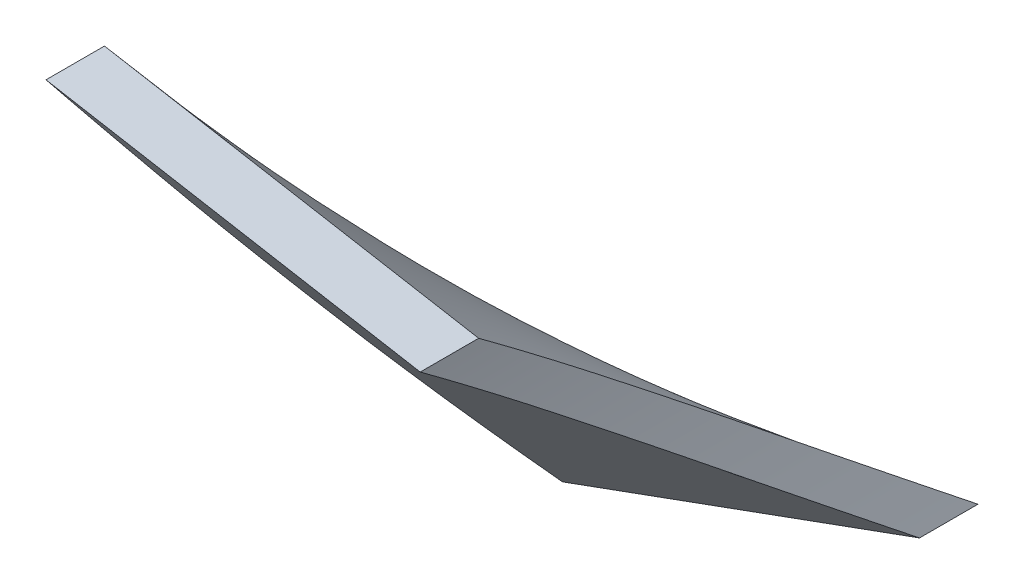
ISO-10303-21;
HEADER;
FILE_DESCRIPTION(('STEP AP214'),'2;1');
FILE_NAME('part.step','',(''),(''),'','','');
FILE_SCHEMA(('AUTOMOTIVE_DESIGN { 1 0 10303 214 1 1 1 1 }'));
ENDSEC;
DATA;
#1=APPLICATION_CONTEXT('core data for automotive mechanical design processes');
#2=APPLICATION_PROTOCOL_DEFINITION('international standard','automotive_design',2000,#1);
#3=PRODUCT_CONTEXT('',#1,'mechanical');
#4=PRODUCT('Part','Part','',(#3));
#5=PRODUCT_RELATED_PRODUCT_CATEGORY('part','',(#4));
#6=PRODUCT_DEFINITION_FORMATION('','',#4);
#7=PRODUCT_DEFINITION_CONTEXT('part definition',#1,'design');
#8=PRODUCT_DEFINITION('design','',#6,#7);
#9=PRODUCT_DEFINITION_SHAPE('','',#8);
#10=(LENGTH_UNIT() NAMED_UNIT(*) SI_UNIT(.MILLI.,.METRE.));
#11=(NAMED_UNIT(*) PLANE_ANGLE_UNIT() SI_UNIT($,.RADIAN.));
#12=(NAMED_UNIT(*) SI_UNIT($,.STERADIAN.) SOLID_ANGLE_UNIT());
#13=UNCERTAINTY_MEASURE_WITH_UNIT(LENGTH_MEASURE(1.E-05),#10,'distance_accuracy_value','');
#14=(GEOMETRIC_REPRESENTATION_CONTEXT(3) GLOBAL_UNCERTAINTY_ASSIGNED_CONTEXT((#13)) GLOBAL_UNIT_ASSIGNED_CONTEXT((#10,
#11,#12)) REPRESENTATION_CONTEXT('',''));
#15=CARTESIAN_POINT('',(0.,0.,0.));
#16=DIRECTION('',(0.,0.,1.));
#17=DIRECTION('',(1.,0.,0.));
#18=AXIS2_PLACEMENT_3D('',#15,#16,#17);
#19=CARTESIAN_POINT('',(-11.2763114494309,-4.10424171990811,2.));
#20=CARTESIAN_POINT('',(-11.6566254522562,-3.0593375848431,3.41176470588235));
#21=CARTESIAN_POINT('',(-11.8384632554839,-1.96234241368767,4.82352941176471));
#22=CARTESIAN_POINT('',(-12.0203010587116,-0.865347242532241,6.23529411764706));
#23=CARTESIAN_POINT('',(-11.9974703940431,0.246382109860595,7.64705882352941));
#24=CARTESIAN_POINT('',(-11.9784651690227,1.17183333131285,8.82227234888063));
#25=CARTESIAN_POINT('',(-11.8177558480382,2.08342187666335,10.0002842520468));
#26=CARTESIAN_POINT('',(-11.8123033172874,2.11435016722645,10.0402517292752));
#27=CARTESIAN_POINT('',(-11.8068507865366,2.14527845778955,10.0802192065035));
#28=CARTESIAN_POINT('',(-17.3843134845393,-6.327372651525,2.));
#29=CARTESIAN_POINT('',(-17.9706309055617,-4.71647877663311,3.41176470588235));
#30=CARTESIAN_POINT('',(-18.2509641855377,-3.02527788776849,4.82352941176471));
#31=CARTESIAN_POINT('',(-18.5312974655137,-1.33407699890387,6.23529411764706));
#32=CARTESIAN_POINT('',(-18.4961001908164,0.379839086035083,7.64705882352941));
#33=CARTESIAN_POINT('',(-18.46680046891,1.80657638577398,8.82227234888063));
#34=CARTESIAN_POINT('',(-18.2190402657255,3.211942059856,10.0002842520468));
#35=CARTESIAN_POINT('',(-18.210634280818,3.25962317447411,10.0402517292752));
#36=CARTESIAN_POINT('',(-18.2022282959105,3.30730428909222,10.0802192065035));
#37=(BOUNDED_SURFACE() B_SPLINE_SURFACE(1,2,((#19,#20,#21,#22,#23,#24,#25,#26,#27),(#28,#29,#30,
#31,#32,#33,#34,#35,#36)),.UNSPECIFIED.,.F.,.F.,.F.) B_SPLINE_SURFACE_WITH_KNOTS((2,2),(3,2,2,2,
3),(0.,1.),(0.,0.0294117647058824,0.0588235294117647,0.0833246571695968,0.0841579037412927),
.UNSPECIFIED.) GEOMETRIC_REPRESENTATION_ITEM() RATIONAL_B_SPLINE_SURFACE(((1.,0.995734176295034,
1.,0.995734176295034,1.,0.996446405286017,0.99881337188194,0.99881337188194,0.99881337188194),
(1.,0.995734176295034,1.,0.995734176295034,1.,0.996446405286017,0.99881337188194,
0.99881337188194,0.99881337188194))) REPRESENTATION_ITEM('') SURFACE());
#38=CARTESIAN_POINT('',(-11.2763114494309,-4.10424171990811,2.));
#39=CARTESIAN_POINT('',(-11.6566254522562,-3.0593375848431,3.41176470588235));
#40=CARTESIAN_POINT('',(-11.8384632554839,-1.96234241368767,4.82352941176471));
#41=CARTESIAN_POINT('',(-12.0203010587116,-0.865347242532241,6.23529411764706));
#42=CARTESIAN_POINT('',(-11.9974703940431,0.246382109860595,7.64705882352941));
#43=CARTESIAN_POINT('',(-11.9784651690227,1.17183333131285,8.82227234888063));
#44=CARTESIAN_POINT('',(-11.8177558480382,2.08342187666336,10.0002842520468));
#45=CARTESIAN_POINT('',(-11.8123033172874,2.11435016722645,10.0402517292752));
#46=CARTESIAN_POINT('',(-11.8068507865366,2.14527845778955,10.0802192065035));
#47=(BOUNDED_CURVE() B_SPLINE_CURVE(2,(#38,#39,#40,#41,#42,#43,#44,#45,#46),.UNSPECIFIED.,.F.,
.F.) B_SPLINE_CURVE_WITH_KNOTS((3,2,2,2,3),(0.,0.0294117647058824,0.0588235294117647,
0.0833246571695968,0.0841579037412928),
.UNSPECIFIED.) CURVE() GEOMETRIC_REPRESENTATION_ITEM() RATIONAL_B_SPLINE_CURVE((1.,
0.995734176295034,1.,0.995734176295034,1.,0.996446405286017,0.99881337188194,0.99881337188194,0.99881337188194)) REPRESENTATION_ITEM(''));
#48=CARTESIAN_POINT('',(-11.2763114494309,-4.10424171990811,2.));
#49=VERTEX_POINT('',#48);
#50=CARTESIAN_POINT('',(-11.8177450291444,2.08348324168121,10.0002842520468));
#51=VERTEX_POINT('',#50);
#52=EDGE_CURVE('E131',#49,#51,#47,.T.);
#53=CARTESIAN_POINT('',(-11.8177342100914,2.08354460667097,10.0004428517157));
#54=CARTESIAN_POINT('',(-12.3534589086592,2.1779964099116,10.0004428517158));
#55=CARTESIAN_POINT('',(-12.889183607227,2.27244821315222,10.0004428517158));
#56=CARTESIAN_POINT('',(-13.9606330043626,2.46135181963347,10.0004428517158));
#57=CARTESIAN_POINT('',(-14.4963577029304,2.55580362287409,10.0004428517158));
#58=CARTESIAN_POINT('',(-16.0943905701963,2.83754737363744,10.0004428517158));
#59=CARTESIAN_POINT('',(-17.1566987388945,3.02483932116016,10.0004428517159));
#60=CARTESIAN_POINT('',(-18.2190069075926,3.21213126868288,10.0004428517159));
#61=B_SPLINE_CURVE_WITH_KNOTS('',3,(#53,#54,#55,#56,#57,#58,#59,#60),.UNSPECIFIED.,.F.,.F.,(4,2,
2,4),(0.,1.63196166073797,3.26392332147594,6.50000000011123),.UNSPECIFIED.);
#62=CARTESIAN_POINT('',(-18.2190152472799,3.21208396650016,10.0003635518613));
#63=VERTEX_POINT('',#62);
#64=EDGE_CURVE('E61',#51,#63,#61,.T.);
#65=CARTESIAN_POINT('',(-17.3843134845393,-6.327372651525,2.));
#66=CARTESIAN_POINT('',(-17.9706309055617,-4.71647877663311,3.41176470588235));
#67=CARTESIAN_POINT('',(-18.2509641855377,-3.02527788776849,4.82352941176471));
#68=CARTESIAN_POINT('',(-18.5312974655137,-1.33407699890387,6.23529411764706));
#69=CARTESIAN_POINT('',(-18.4961001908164,0.379839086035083,7.64705882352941));
#70=CARTESIAN_POINT('',(-18.46680046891,1.80657638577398,8.82227234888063));
#71=CARTESIAN_POINT('',(-18.2190402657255,3.211942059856,10.0002842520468));
#72=CARTESIAN_POINT('',(-18.210634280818,3.25962317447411,10.0402517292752));
#73=CARTESIAN_POINT('',(-18.2022282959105,3.30730428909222,10.0802192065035));
#74=(BOUNDED_CURVE() B_SPLINE_CURVE(2,(#65,#66,#67,#68,#69,#70,#71,#72,#73),.UNSPECIFIED.,.F.,
.F.) B_SPLINE_CURVE_WITH_KNOTS((3,2,2,2,3),(0.,0.0294117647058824,0.0588235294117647,
0.0833246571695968,0.0841579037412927),
.UNSPECIFIED.) CURVE() GEOMETRIC_REPRESENTATION_ITEM() RATIONAL_B_SPLINE_CURVE((1.,
0.995734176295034,1.,0.995734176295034,1.,0.996446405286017,0.99881337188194,0.99881337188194,0.99881337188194)) REPRESENTATION_ITEM(''));
#75=CARTESIAN_POINT('',(-17.3843134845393,-6.327372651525,2.));
#76=VERTEX_POINT('',#75);
#77=EDGE_CURVE('E58',#63,#76,#74,.F.);
#78=DIRECTION('',(0.939692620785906,0.342020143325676,0.));
#79=VECTOR('',#78,1.);
#80=CARTESIAN_POINT('',(-17.3843134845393,-6.327372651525,2.));
#81=LINE('',#80,#79);
#82=EDGE_CURVE('E59',#49,#76,#81,.F.);
#83=ORIENTED_EDGE('',*,*,#52,.T.);
#84=ORIENTED_EDGE('',*,*,#64,.T.);
#85=ORIENTED_EDGE('',*,*,#77,.T.);
#86=ORIENTED_EDGE('',*,*,#82,.F.);
#87=EDGE_LOOP('',(#83,#84,#85,#86));
#88=FACE_BOUND('',#87,.T.);
#89=ADVANCED_FACE('F17',(#88),#37,.F.);
#90=CARTESIAN_POINT('',(-11.2763114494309,-4.10424171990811,1.));
#91=CARTESIAN_POINT('',(-11.6566254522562,-3.0593375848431,2.41176470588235));
#92=CARTESIAN_POINT('',(-11.8384632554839,-1.96234241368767,3.82352941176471));
#93=CARTESIAN_POINT('',(-12.0203010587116,-0.865347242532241,5.23529411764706));
#94=CARTESIAN_POINT('',(-11.9974703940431,0.246382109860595,6.64705882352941));
#95=CARTESIAN_POINT('',(-11.9784651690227,1.17183333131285,7.82227234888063));
#96=CARTESIAN_POINT('',(-11.8177558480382,2.08342187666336,9.00028425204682));
#97=CARTESIAN_POINT('',(-11.8123033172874,2.11435016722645,9.04025172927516));
#98=CARTESIAN_POINT('',(-11.8068507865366,2.14527845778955,9.08021920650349));
#99=CARTESIAN_POINT('',(-11.2763114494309,-4.10424171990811,2.));
#100=CARTESIAN_POINT('',(-11.6566254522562,-3.0593375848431,3.41176470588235));
#101=CARTESIAN_POINT('',(-11.8384632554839,-1.96234241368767,4.82352941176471));
#102=CARTESIAN_POINT('',(-12.0203010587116,-0.865347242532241,6.23529411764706));
#103=CARTESIAN_POINT('',(-11.9974703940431,0.246382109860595,7.64705882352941));
#104=CARTESIAN_POINT('',(-11.9784651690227,1.17183333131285,8.82227234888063));
#105=CARTESIAN_POINT('',(-11.8177558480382,2.08342187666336,10.0002842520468));
#106=CARTESIAN_POINT('',(-11.8123033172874,2.11435016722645,10.0402517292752));
#107=CARTESIAN_POINT('',(-11.8068507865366,2.14527845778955,10.0802192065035));
#108=(BOUNDED_SURFACE() B_SPLINE_SURFACE(1,2,((#90,#91,#92,#93,#94,#95,#96,#97,#98),(#99,#100,
#101,#102,#103,#104,#105,#106,#107)),.UNSPECIFIED.,.F.,.F.,.F.) B_SPLINE_SURFACE_WITH_KNOTS((2,
2),(3,2,2,2,3),(0.,1.),(0.,0.0294117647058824,0.0588235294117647,0.0833246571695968,
0.0841579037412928),
.UNSPECIFIED.) GEOMETRIC_REPRESENTATION_ITEM() RATIONAL_B_SPLINE_SURFACE(((1.,0.995734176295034,
1.,0.995734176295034,1.,0.996446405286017,0.99881337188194,0.99881337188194,0.99881337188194),
(1.,0.995734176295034,1.,0.995734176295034,1.,0.996446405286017,0.99881337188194,
0.99881337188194,0.99881337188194))) REPRESENTATION_ITEM('') SURFACE());
#109=CARTESIAN_POINT('',(-11.2763114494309,-4.10424171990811,1.));
#110=CARTESIAN_POINT('',(-11.6566254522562,-3.0593375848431,2.41176470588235));
#111=CARTESIAN_POINT('',(-11.8384632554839,-1.96234241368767,3.82352941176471));
#112=CARTESIAN_POINT('',(-12.0203010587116,-0.865347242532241,5.23529411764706));
#113=CARTESIAN_POINT('',(-11.9974703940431,0.246382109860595,6.64705882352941));
#114=CARTESIAN_POINT('',(-11.9784651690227,1.17183333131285,7.82227234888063));
#115=CARTESIAN_POINT('',(-11.8177558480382,2.08342187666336,9.00028425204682));
#116=CARTESIAN_POINT('',(-11.8123033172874,2.11435016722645,9.04025172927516));
#117=CARTESIAN_POINT('',(-11.8068507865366,2.14527845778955,9.08021920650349));
#118=(BOUNDED_CURVE() B_SPLINE_CURVE(2,(#109,#110,#111,#112,#113,#114,#115,#116,#117),
.UNSPECIFIED.,.F.,.F.) B_SPLINE_CURVE_WITH_KNOTS((3,2,2,2,3),(0.,0.0294117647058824,
0.0588235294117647,0.0833246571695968,0.0841579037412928),
.UNSPECIFIED.) CURVE() GEOMETRIC_REPRESENTATION_ITEM() RATIONAL_B_SPLINE_CURVE((1.,
0.995734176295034,1.,0.995734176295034,1.,0.996446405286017,0.99881337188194,0.99881337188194,0.99881337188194)) REPRESENTATION_ITEM(''));
#119=CARTESIAN_POINT('',(-11.2763114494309,-4.10424171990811,1.));
#120=VERTEX_POINT('',#119);
#121=CARTESIAN_POINT('',(-11.8177342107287,2.08354460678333,9.00044285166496));
#122=VERTEX_POINT('',#121);
#123=EDGE_CURVE('E70',#120,#122,#118,.T.);
#124=DIRECTION('',(0.,0.,1.));
#125=VECTOR('',#124,1.);
#126=CARTESIAN_POINT('',(-11.8177342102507,2.08354460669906,9.2504428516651));
#127=LINE('',#126,#125);
#128=EDGE_CURVE('E127',#122,#51,#127,.T.);
#129=DIRECTION('',(0.,0.,1.));
#130=VECTOR('',#129,1.);
#131=CARTESIAN_POINT('',(-11.2763114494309,-4.10424171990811,1.5));
#132=LINE('',#131,#130);
#133=EDGE_CURVE('E69',#120,#49,#132,.T.);
#134=ORIENTED_EDGE('',*,*,#123,.T.);
#135=ORIENTED_EDGE('',*,*,#128,.T.);
#136=ORIENTED_EDGE('',*,*,#52,.F.);
#137=ORIENTED_EDGE('',*,*,#133,.F.);
#138=EDGE_LOOP('',(#134,#135,#136,#137));
#139=FACE_BOUND('',#138,.T.);
#140=ADVANCED_FACE('F119',(#139),#108,.F.);
#141=CARTESIAN_POINT('',(-18.219006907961,3.21213126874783,9.2504428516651));
#142=DIRECTION('',(-0.173628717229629,-0.984811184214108,0.));
#143=DIRECTION('',(0.984811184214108,-0.173628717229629,0.));
#144=AXIS2_PLACEMENT_3D('',#141,#142,#143);
#145=PLANE('',#144);
#146=ORIENTED_EDGE('',*,*,#64,.F.);
#147=ORIENTED_EDGE('',*,*,#128,.F.);
#148=CARTESIAN_POINT('',(-11.81773421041,2.08354460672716,9.00044285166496));
#149=CARTESIAN_POINT('',(-12.3534589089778,2.1779964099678,9.00044285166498));
#150=CARTESIAN_POINT('',(-12.8891836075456,2.27244821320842,9.00044285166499));
#151=CARTESIAN_POINT('',(-13.9606330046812,2.46135181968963,9.00044285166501));
#152=CARTESIAN_POINT('',(-14.496357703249,2.55580362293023,9.00044285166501));
#153=CARTESIAN_POINT('',(-16.0943905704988,2.83754737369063,9.000442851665));
#154=CARTESIAN_POINT('',(-17.1566987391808,3.02483932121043,9.00044285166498));
#155=CARTESIAN_POINT('',(-18.2190069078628,3.21213126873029,9.000442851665));
#156=B_SPLINE_CURVE_WITH_KNOTS('',3,(#148,#149,#150,#151,#152,#153,#154,#155),.UNSPECIFIED.,.F.,
.F.,(4,2,2,4),(0.,1.63196166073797,3.26392332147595,6.50000000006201),.UNSPECIFIED.);
#157=CARTESIAN_POINT('',(-18.2190069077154,3.21213126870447,9.0004428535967));
#158=VERTEX_POINT('',#157);
#159=EDGE_CURVE('E80',#122,#158,#156,.T.);
#160=ORIENTED_EDGE('',*,*,#159,.T.);
#161=DIRECTION('',(0.,0.,1.));
#162=VECTOR('',#161,1.);
#163=CARTESIAN_POINT('',(-18.2190069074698,3.21213126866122,9.2504428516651));
#164=LINE('',#163,#162);
#165=EDGE_CURVE('E64',#158,#63,#164,.T.);
#166=ORIENTED_EDGE('',*,*,#165,.T.);
#167=EDGE_LOOP('',(#146,#147,#160,#166));
#168=FACE_BOUND('',#167,.T.);
#169=ADVANCED_FACE('F91',(#168),#145,.F.);
#170=CARTESIAN_POINT('',(-17.3843134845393,-6.327372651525,2.));
#171=CARTESIAN_POINT('',(-17.9706309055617,-4.71647877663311,3.41176470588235));
#172=CARTESIAN_POINT('',(-18.2509641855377,-3.02527788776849,4.82352941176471));
#173=CARTESIAN_POINT('',(-18.5312974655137,-1.33407699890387,6.23529411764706));
#174=CARTESIAN_POINT('',(-18.4961001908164,0.379839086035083,7.64705882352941));
#175=CARTESIAN_POINT('',(-18.4667984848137,1.80667300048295,8.82235193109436));
#176=CARTESIAN_POINT('',(-18.219006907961,3.21213126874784,10.0004428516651));
#177=CARTESIAN_POINT('',(-17.3843134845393,-6.327372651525,1.));
#178=CARTESIAN_POINT('',(-17.9706309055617,-4.71647877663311,2.41176470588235));
#179=CARTESIAN_POINT('',(-18.2509641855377,-3.02527788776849,3.82352941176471));
#180=CARTESIAN_POINT('',(-18.5312974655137,-1.33407699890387,5.23529411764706));
#181=CARTESIAN_POINT('',(-18.4961001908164,0.379839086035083,6.64705882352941));
#182=CARTESIAN_POINT('',(-18.4667984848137,1.80667300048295,7.82235193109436));
#183=CARTESIAN_POINT('',(-18.219006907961,3.21213126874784,9.0004428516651));
#184=(BOUNDED_SURFACE() B_SPLINE_SURFACE(1,2,((#170,#171,#172,#173,#174,#175,#176),(#177,#178,
#179,#180,#181,#182,#183)),.UNSPECIFIED.,.F.,.F.,.F.) B_SPLINE_SURFACE_WITH_KNOTS((2,2),(3,2,2,
3),(0.,1.),(0.,0.0294117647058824,0.0588235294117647,0.083326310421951),
.UNSPECIFIED.) GEOMETRIC_REPRESENTATION_ITEM() RATIONAL_B_SPLINE_SURFACE(((1.,0.995734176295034,
1.,0.995734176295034,1.,0.996446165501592,0.998813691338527),(1.,0.995734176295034,1.,
0.995734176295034,1.,0.996446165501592,0.998813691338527))) REPRESENTATION_ITEM('') SURFACE());
#185=CARTESIAN_POINT('',(-17.3843134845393,-6.327372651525,1.));
#186=CARTESIAN_POINT('',(-17.9706309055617,-4.71647877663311,2.41176470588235));
#187=CARTESIAN_POINT('',(-18.2509641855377,-3.02527788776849,3.82352941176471));
#188=CARTESIAN_POINT('',(-18.5312974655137,-1.33407699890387,5.23529411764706));
#189=CARTESIAN_POINT('',(-18.4961001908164,0.379839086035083,6.64705882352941));
#190=CARTESIAN_POINT('',(-18.4667984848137,1.80667300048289,7.82235193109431));
#191=CARTESIAN_POINT('',(-18.2190069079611,3.21213126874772,9.000442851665));
#192=(BOUNDED_CURVE() B_SPLINE_CURVE(2,(#185,#186,#187,#188,#189,#190,#191),.UNSPECIFIED.,.F.,
.F.) B_SPLINE_CURVE_WITH_KNOTS((3,2,2,3),(0.,0.0294117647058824,0.0588235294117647,
0.0833263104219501),
.UNSPECIFIED.) CURVE() GEOMETRIC_REPRESENTATION_ITEM() RATIONAL_B_SPLINE_CURVE((1.,
0.995734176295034,1.,0.995734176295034,1.,0.996446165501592,0.998813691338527)) REPRESENTATION_ITEM(''));
#193=CARTESIAN_POINT('',(-17.3843134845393,-6.327372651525,1.));
#194=VERTEX_POINT('',#193);
#195=EDGE_CURVE('E29',#158,#194,#192,.F.);
#196=DIRECTION('',(0.,0.,1.));
#197=VECTOR('',#196,1.);
#198=CARTESIAN_POINT('',(-17.3843134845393,-6.327372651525,1.5));
#199=LINE('',#198,#197);
#200=EDGE_CURVE('E37',#76,#194,#199,.F.);
#201=ORIENTED_EDGE('',*,*,#77,.F.);
#202=ORIENTED_EDGE('',*,*,#165,.F.);
#203=ORIENTED_EDGE('',*,*,#195,.T.);
#204=ORIENTED_EDGE('',*,*,#200,.F.);
#205=EDGE_LOOP('',(#201,#202,#203,#204));
#206=FACE_BOUND('',#205,.T.);
#207=ADVANCED_FACE('F73',(#206),#184,.F.);
#208=CARTESIAN_POINT('',(-17.3843134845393,-6.327372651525,1.5));
#209=DIRECTION('',(0.342020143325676,-0.939692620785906,0.));
#210=DIRECTION('',(0.939692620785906,0.342020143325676,0.));
#211=AXIS2_PLACEMENT_3D('',#208,#209,#210);
#212=PLANE('',#211);
#213=ORIENTED_EDGE('',*,*,#133,.T.);
#214=ORIENTED_EDGE('',*,*,#82,.T.);
#215=ORIENTED_EDGE('',*,*,#200,.T.);
#216=DIRECTION('',(0.939692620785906,0.342020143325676,0.));
#217=VECTOR('',#216,1.);
#218=CARTESIAN_POINT('',(-14.3303124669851,-5.21580718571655,1.));
#219=LINE('',#218,#217);
#220=EDGE_CURVE('E11',#194,#120,#219,.T.);
#221=ORIENTED_EDGE('',*,*,#220,.T.);
#222=EDGE_LOOP('',(#213,#214,#215,#221));
#223=FACE_BOUND('',#222,.T.);
#224=ADVANCED_FACE('F67',(#223),#212,.T.);
#225=CARTESIAN_POINT('',(-17.3843134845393,-6.327372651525,1.));
#226=CARTESIAN_POINT('',(-17.9706309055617,-4.71647877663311,2.41176470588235));
#227=CARTESIAN_POINT('',(-18.2509641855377,-3.02527788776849,3.82352941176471));
#228=CARTESIAN_POINT('',(-18.5312974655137,-1.33407699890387,5.23529411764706));
#229=CARTESIAN_POINT('',(-18.4961001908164,0.379839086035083,6.64705882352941));
#230=CARTESIAN_POINT('',(-18.4667984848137,1.80667300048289,7.82235193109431));
#231=CARTESIAN_POINT('',(-18.2190069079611,3.21213126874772,9.000442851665));
#232=CARTESIAN_POINT('',(-11.2763114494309,-4.10424171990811,1.));
#233=CARTESIAN_POINT('',(-11.6566254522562,-3.0593375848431,2.41176470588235));
#234=CARTESIAN_POINT('',(-11.8384632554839,-1.96234241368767,3.82352941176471));
#235=CARTESIAN_POINT('',(-12.0203010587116,-0.865347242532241,5.23529411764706));
#236=CARTESIAN_POINT('',(-11.9974703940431,0.246382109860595,6.64705882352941));
#237=CARTESIAN_POINT('',(-11.9784638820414,1.17189600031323,7.82235193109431));
#238=CARTESIAN_POINT('',(-11.8177342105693,2.08354460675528,9.000442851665));
#239=(BOUNDED_SURFACE() B_SPLINE_SURFACE(1,2,((#225,#226,#227,#228,#229,#230,#231),(#232,#233,
#234,#235,#236,#237,#238)),.UNSPECIFIED.,.F.,.F.,.F.) B_SPLINE_SURFACE_WITH_KNOTS((2,2),(3,2,2,
3),(0.,1.),(0.,0.0294117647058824,0.0588235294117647,0.0833263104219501),
.UNSPECIFIED.) GEOMETRIC_REPRESENTATION_ITEM() RATIONAL_B_SPLINE_SURFACE(((1.,0.995734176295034,
1.,0.995734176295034,1.,0.996446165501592,0.998813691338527),(1.,0.995734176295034,1.,
0.995734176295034,1.,0.996446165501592,0.998813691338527))) REPRESENTATION_ITEM('') SURFACE());
#240=ORIENTED_EDGE('',*,*,#195,.F.);
#241=ORIENTED_EDGE('',*,*,#159,.F.);
#242=ORIENTED_EDGE('',*,*,#123,.F.);
#243=ORIENTED_EDGE('',*,*,#220,.F.);
#244=EDGE_LOOP('',(#240,#241,#242,#243));
#245=FACE_BOUND('',#244,.T.);
#246=ADVANCED_FACE('F94',(#245),#239,.F.);
#247=CLOSED_SHELL('',(#89,#140,#169,#207,#224,#246));
#248=MANIFOLD_SOLID_BREP('B1',#247);
#249=ADVANCED_BREP_SHAPE_REPRESENTATION('',(#18,#248),#14);
#250=SHAPE_DEFINITION_REPRESENTATION(#9,#249);
ENDSEC;
END-ISO-10303-21;
